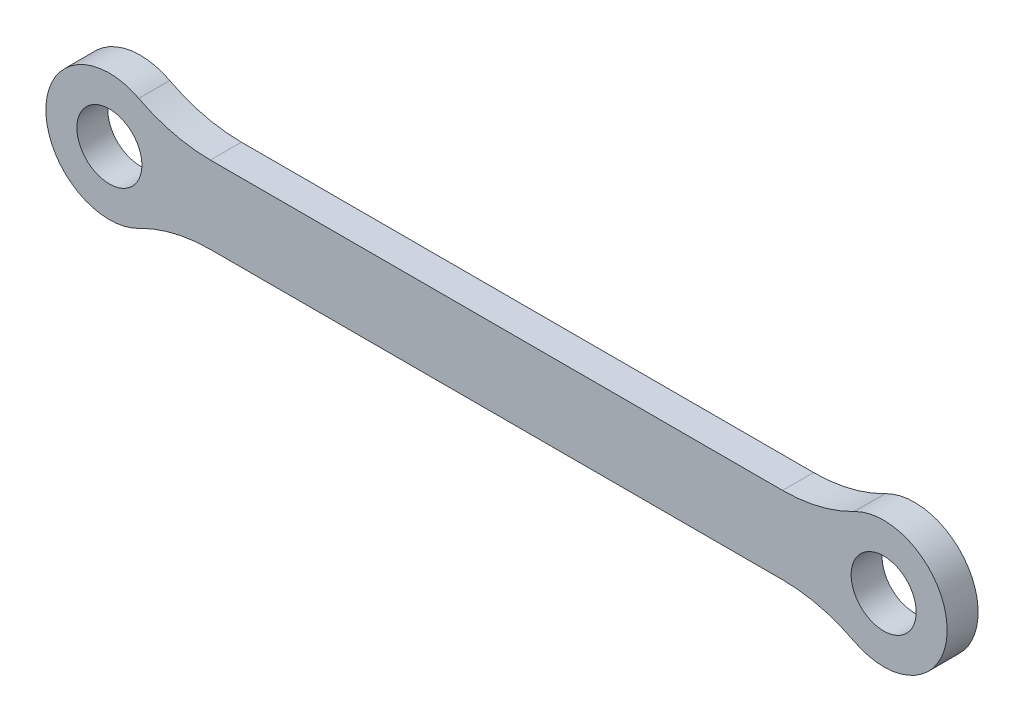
ISO-10303-21;
HEADER;
FILE_DESCRIPTION(('STEP AP214'),'2;1');
FILE_NAME('part.step','',(''),(''),'','','');
FILE_SCHEMA(('AUTOMOTIVE_DESIGN { 1 0 10303 214 1 1 1 1 }'));
ENDSEC;
DATA;
#1=APPLICATION_CONTEXT('core data for automotive mechanical design processes');
#2=APPLICATION_PROTOCOL_DEFINITION('international standard','automotive_design',2000,#1);
#3=PRODUCT_CONTEXT('',#1,'mechanical');
#4=PRODUCT('Part','Part','',(#3));
#5=PRODUCT_RELATED_PRODUCT_CATEGORY('part','',(#4));
#6=PRODUCT_DEFINITION_FORMATION('','',#4);
#7=PRODUCT_DEFINITION_CONTEXT('part definition',#1,'design');
#8=PRODUCT_DEFINITION('design','',#6,#7);
#9=PRODUCT_DEFINITION_SHAPE('','',#8);
#10=(LENGTH_UNIT() NAMED_UNIT(*) SI_UNIT(.MILLI.,.METRE.));
#11=(NAMED_UNIT(*) PLANE_ANGLE_UNIT() SI_UNIT($,.RADIAN.));
#12=(NAMED_UNIT(*) SI_UNIT($,.STERADIAN.) SOLID_ANGLE_UNIT());
#13=UNCERTAINTY_MEASURE_WITH_UNIT(LENGTH_MEASURE(1.E-05),#10,'distance_accuracy_value','');
#14=(GEOMETRIC_REPRESENTATION_CONTEXT(3) GLOBAL_UNCERTAINTY_ASSIGNED_CONTEXT((#13)) GLOBAL_UNIT_ASSIGNED_CONTEXT((#10,
#11,#12)) REPRESENTATION_CONTEXT('',''));
#15=CARTESIAN_POINT('',(0.,0.,0.));
#16=DIRECTION('',(0.,0.,1.));
#17=DIRECTION('',(1.,0.,0.));
#18=AXIS2_PLACEMENT_3D('',#15,#16,#17);
#19=CARTESIAN_POINT('',(-25.,0.,1.));
#20=DIRECTION('',(0.,0.,1.));
#21=DIRECTION('',(1.,0.,0.));
#22=AXIS2_PLACEMENT_3D('',#19,#20,#21);
#23=PLANE('',#22);
#24=CARTESIAN_POINT('',(25.,0.,1.));
#25=DIRECTION('',(0.,0.,1.));
#26=DIRECTION('',(1.,0.,0.));
#27=AXIS2_PLACEMENT_3D('',#24,#25,#26);
#28=CIRCLE('',#27,2.1);
#29=CARTESIAN_POINT('',(27.1,0.,1.));
#30=VERTEX_POINT('',#29);
#31=EDGE_CURVE('E147',#30,#30,#28,.T.);
#32=ORIENTED_EDGE('',*,*,#31,.F.);
#33=EDGE_LOOP('',(#32));
#34=FACE_BOUND('',#33,.T.);
#35=DIRECTION('',(-1.,0.,0.));
#36=VECTOR('',#35,1.);
#37=CARTESIAN_POINT('',(-21.7503846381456,2.5,1.));
#38=LINE('',#37,#36);
#39=CARTESIAN_POINT('',(18.47619742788,2.5,1.));
#40=VERTEX_POINT('',#39);
#41=CARTESIAN_POINT('',(-18.47619742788,2.5,1.));
#42=VERTEX_POINT('',#41);
#43=EDGE_CURVE('E155',#40,#42,#38,.T.);
#44=ORIENTED_EDGE('',*,*,#43,.T.);
#45=CARTESIAN_POINT('',(-18.47619742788,12.5,1.));
#46=DIRECTION('',(0.,0.,1.));
#47=DIRECTION('',(1.,0.,0.));
#48=AXIS2_PLACEMENT_3D('',#45,#46,#47);
#49=CIRCLE('',#48,10.);
#50=CARTESIAN_POINT('',(-23.1030077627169,3.63475177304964,1.));
#51=VERTEX_POINT('',#50);
#52=EDGE_CURVE('E11',#42,#51,#49,.F.);
#53=ORIENTED_EDGE('',*,*,#52,.T.);
#54=CARTESIAN_POINT('',(-25.,0.,1.));
#55=DIRECTION('',(0.,0.,1.));
#56=DIRECTION('',(1.,0.,0.));
#57=AXIS2_PLACEMENT_3D('',#54,#55,#56);
#58=CIRCLE('',#57,4.1);
#59=CARTESIAN_POINT('',(-23.1030077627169,-3.63475177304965,1.));
#60=VERTEX_POINT('',#59);
#61=EDGE_CURVE('E153',#51,#60,#58,.T.);
#62=ORIENTED_EDGE('',*,*,#61,.T.);
#63=CARTESIAN_POINT('',(-18.47619742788,-12.5,1.));
#64=DIRECTION('',(0.,0.,1.));
#65=DIRECTION('',(1.,0.,0.));
#66=AXIS2_PLACEMENT_3D('',#63,#64,#65);
#67=CIRCLE('',#66,10.);
#68=CARTESIAN_POINT('',(-18.47619742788,-2.5,1.));
#69=VERTEX_POINT('',#68);
#70=EDGE_CURVE('E120',#60,#69,#67,.F.);
#71=ORIENTED_EDGE('',*,*,#70,.T.);
#72=DIRECTION('',(1.,0.,0.));
#73=VECTOR('',#72,1.);
#74=CARTESIAN_POINT('',(-21.7503846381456,-2.5,1.));
#75=LINE('',#74,#73);
#76=CARTESIAN_POINT('',(18.47619742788,-2.5,1.));
#77=VERTEX_POINT('',#76);
#78=EDGE_CURVE('E130',#69,#77,#75,.T.);
#79=ORIENTED_EDGE('',*,*,#78,.T.);
#80=CARTESIAN_POINT('',(18.47619742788,-12.5,1.));
#81=DIRECTION('',(0.,0.,1.));
#82=DIRECTION('',(1.,0.,0.));
#83=AXIS2_PLACEMENT_3D('',#80,#81,#82);
#84=CIRCLE('',#83,10.);
#85=CARTESIAN_POINT('',(23.1030077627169,-3.63475177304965,1.));
#86=VERTEX_POINT('',#85);
#87=EDGE_CURVE('E174',#77,#86,#84,.F.);
#88=ORIENTED_EDGE('',*,*,#87,.T.);
#89=CARTESIAN_POINT('',(25.,0.,1.));
#90=DIRECTION('',(0.,0.,1.));
#91=DIRECTION('',(-1.,0.,0.));
#92=AXIS2_PLACEMENT_3D('',#89,#90,#91);
#93=CIRCLE('',#92,4.1);
#94=CARTESIAN_POINT('',(23.1030077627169,3.63475177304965,1.));
#95=VERTEX_POINT('',#94);
#96=EDGE_CURVE('E193',#86,#95,#93,.T.);
#97=ORIENTED_EDGE('',*,*,#96,.T.);
#98=CARTESIAN_POINT('',(18.47619742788,12.5,1.));
#99=DIRECTION('',(0.,0.,1.));
#100=DIRECTION('',(1.,0.,0.));
#101=AXIS2_PLACEMENT_3D('',#98,#99,#100);
#102=CIRCLE('',#101,10.);
#103=EDGE_CURVE('E61',#95,#40,#102,.F.);
#104=ORIENTED_EDGE('',*,*,#103,.T.);
#105=EDGE_LOOP('',(#44,#53,#62,#71,#79,#88,#97,#104));
#106=FACE_BOUND('',#105,.T.);
#107=CARTESIAN_POINT('',(-25.,0.,1.));
#108=DIRECTION('',(0.,0.,1.));
#109=DIRECTION('',(-1.,0.,0.));
#110=AXIS2_PLACEMENT_3D('',#107,#108,#109);
#111=CIRCLE('',#110,2.1);
#112=CARTESIAN_POINT('',(-27.1,0.,1.));
#113=VERTEX_POINT('',#112);
#114=EDGE_CURVE('E204',#113,#113,#111,.T.);
#115=ORIENTED_EDGE('',*,*,#114,.F.);
#116=EDGE_LOOP('',(#115));
#117=FACE_BOUND('',#116,.T.);
#118=ADVANCED_FACE('F36',(#34,#106,#117),#23,.T.);
#119=CARTESIAN_POINT('',(-25.,0.,-1.));
#120=DIRECTION('',(0.,0.,1.));
#121=DIRECTION('',(1.,0.,0.));
#122=AXIS2_PLACEMENT_3D('',#119,#120,#121);
#123=PLANE('',#122);
#124=CARTESIAN_POINT('',(-25.,0.,-1.));
#125=DIRECTION('',(0.,0.,1.));
#126=DIRECTION('',(1.,0.,0.));
#127=AXIS2_PLACEMENT_3D('',#124,#125,#126);
#128=CIRCLE('',#127,4.1);
#129=CARTESIAN_POINT('',(-23.1030077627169,3.63475177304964,-1.));
#130=VERTEX_POINT('',#129);
#131=CARTESIAN_POINT('',(-23.1030077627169,-3.63475177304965,-1.));
#132=VERTEX_POINT('',#131);
#133=EDGE_CURVE('E140',#130,#132,#128,.T.);
#134=ORIENTED_EDGE('',*,*,#133,.F.);
#135=CARTESIAN_POINT('',(-18.47619742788,12.5,-1.));
#136=DIRECTION('',(0.,0.,1.));
#137=DIRECTION('',(1.,0.,0.));
#138=AXIS2_PLACEMENT_3D('',#135,#136,#137);
#139=CIRCLE('',#138,10.);
#140=CARTESIAN_POINT('',(-18.47619742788,2.5,-1.));
#141=VERTEX_POINT('',#140);
#142=EDGE_CURVE('E44',#130,#141,#139,.T.);
#143=ORIENTED_EDGE('',*,*,#142,.T.);
#144=DIRECTION('',(-1.,0.,0.));
#145=VECTOR('',#144,1.);
#146=CARTESIAN_POINT('',(-21.7503846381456,2.5,-1.));
#147=LINE('',#146,#145);
#148=CARTESIAN_POINT('',(18.47619742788,2.5,-1.));
#149=VERTEX_POINT('',#148);
#150=EDGE_CURVE('E145',#149,#141,#147,.T.);
#151=ORIENTED_EDGE('',*,*,#150,.F.);
#152=CARTESIAN_POINT('',(18.47619742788,12.5,-1.));
#153=DIRECTION('',(0.,0.,1.));
#154=DIRECTION('',(1.,0.,0.));
#155=AXIS2_PLACEMENT_3D('',#152,#153,#154);
#156=CIRCLE('',#155,10.);
#157=CARTESIAN_POINT('',(23.1030077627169,3.63475177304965,-1.));
#158=VERTEX_POINT('',#157);
#159=EDGE_CURVE('E177',#149,#158,#156,.T.);
#160=ORIENTED_EDGE('',*,*,#159,.T.);
#161=CARTESIAN_POINT('',(25.,0.,-1.));
#162=DIRECTION('',(0.,0.,1.));
#163=DIRECTION('',(-1.,0.,0.));
#164=AXIS2_PLACEMENT_3D('',#161,#162,#163);
#165=CIRCLE('',#164,4.1);
#166=CARTESIAN_POINT('',(23.1030077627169,-3.63475177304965,-1.));
#167=VERTEX_POINT('',#166);
#168=EDGE_CURVE('E139',#167,#158,#165,.T.);
#169=ORIENTED_EDGE('',*,*,#168,.F.);
#170=CARTESIAN_POINT('',(18.47619742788,-12.5,-1.));
#171=DIRECTION('',(0.,0.,1.));
#172=DIRECTION('',(1.,0.,0.));
#173=AXIS2_PLACEMENT_3D('',#170,#171,#172);
#174=CIRCLE('',#173,10.);
#175=CARTESIAN_POINT('',(18.47619742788,-2.5,-1.));
#176=VERTEX_POINT('',#175);
#177=EDGE_CURVE('E137',#167,#176,#174,.T.);
#178=ORIENTED_EDGE('',*,*,#177,.T.);
#179=DIRECTION('',(1.,0.,0.));
#180=VECTOR('',#179,1.);
#181=CARTESIAN_POINT('',(-21.7503846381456,-2.5,-1.));
#182=LINE('',#181,#180);
#183=CARTESIAN_POINT('',(-18.47619742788,-2.5,-1.));
#184=VERTEX_POINT('',#183);
#185=EDGE_CURVE('E127',#184,#176,#182,.T.);
#186=ORIENTED_EDGE('',*,*,#185,.F.);
#187=CARTESIAN_POINT('',(-18.47619742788,-12.5,-1.));
#188=DIRECTION('',(0.,0.,1.));
#189=DIRECTION('',(1.,0.,0.));
#190=AXIS2_PLACEMENT_3D('',#187,#188,#189);
#191=CIRCLE('',#190,10.);
#192=EDGE_CURVE('E110',#184,#132,#191,.T.);
#193=ORIENTED_EDGE('',*,*,#192,.T.);
#194=EDGE_LOOP('',(#134,#143,#151,#160,#169,#178,#186,#193));
#195=FACE_BOUND('',#194,.T.);
#196=CARTESIAN_POINT('',(25.,0.,-1.));
#197=DIRECTION('',(0.,0.,1.));
#198=DIRECTION('',(1.,0.,0.));
#199=AXIS2_PLACEMENT_3D('',#196,#197,#198);
#200=CIRCLE('',#199,2.1);
#201=CARTESIAN_POINT('',(27.1,0.,-1.));
#202=VERTEX_POINT('',#201);
#203=EDGE_CURVE('E196',#202,#202,#200,.T.);
#204=ORIENTED_EDGE('',*,*,#203,.T.);
#205=EDGE_LOOP('',(#204));
#206=FACE_BOUND('',#205,.T.);
#207=CARTESIAN_POINT('',(-25.,0.,-1.));
#208=DIRECTION('',(0.,0.,1.));
#209=DIRECTION('',(-1.,0.,0.));
#210=AXIS2_PLACEMENT_3D('',#207,#208,#209);
#211=CIRCLE('',#210,2.1);
#212=CARTESIAN_POINT('',(-27.1,0.,-1.));
#213=VERTEX_POINT('',#212);
#214=EDGE_CURVE('E209',#213,#213,#211,.T.);
#215=ORIENTED_EDGE('',*,*,#214,.T.);
#216=EDGE_LOOP('',(#215));
#217=FACE_BOUND('',#216,.T.);
#218=ADVANCED_FACE('F134',(#195,#206,#217),#123,.F.);
#219=CARTESIAN_POINT('',(-25.,0.,1.));
#220=DIRECTION('',(0.,0.,-1.));
#221=DIRECTION('',(-1.,0.,0.));
#222=AXIS2_PLACEMENT_3D('',#219,#220,#221);
#223=CYLINDRICAL_SURFACE('',#222,4.1);
#224=ORIENTED_EDGE('',*,*,#133,.T.);
#225=DIRECTION('',(0.,0.,-1.));
#226=VECTOR('',#225,1.);
#227=CARTESIAN_POINT('',(-23.1030077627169,-3.63475177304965,1.));
#228=LINE('',#227,#226);
#229=EDGE_CURVE('E115',#132,#60,#228,.F.);
#230=ORIENTED_EDGE('',*,*,#229,.T.);
#231=ORIENTED_EDGE('',*,*,#61,.F.);
#232=DIRECTION('',(0.,0.,-1.));
#233=VECTOR('',#232,1.);
#234=CARTESIAN_POINT('',(-23.1030077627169,3.63475177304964,1.));
#235=LINE('',#234,#233);
#236=EDGE_CURVE('E131',#51,#130,#235,.T.);
#237=ORIENTED_EDGE('',*,*,#236,.T.);
#238=EDGE_LOOP('',(#224,#230,#231,#237));
#239=FACE_BOUND('',#238,.T.);
#240=ADVANCED_FACE('F191',(#239),#223,.T.);
#241=CARTESIAN_POINT('',(-21.7503846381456,-2.5,1.));
#242=DIRECTION('',(0.,1.,0.));
#243=DIRECTION('',(-1.,0.,0.));
#244=AXIS2_PLACEMENT_3D('',#241,#242,#243);
#245=PLANE('',#244);
#246=ORIENTED_EDGE('',*,*,#78,.F.);
#247=DIRECTION('',(0.,0.,1.));
#248=VECTOR('',#247,1.);
#249=CARTESIAN_POINT('',(-18.47619742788,-2.5,-1.));
#250=LINE('',#249,#248);
#251=EDGE_CURVE('E114',#69,#184,#250,.F.);
#252=ORIENTED_EDGE('',*,*,#251,.T.);
#253=ORIENTED_EDGE('',*,*,#185,.T.);
#254=DIRECTION('',(0.,0.,1.));
#255=VECTOR('',#254,1.);
#256=CARTESIAN_POINT('',(18.47619742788,-2.5,1.));
#257=LINE('',#256,#255);
#258=EDGE_CURVE('E132',#176,#77,#257,.T.);
#259=ORIENTED_EDGE('',*,*,#258,.T.);
#260=EDGE_LOOP('',(#246,#252,#253,#259));
#261=FACE_BOUND('',#260,.T.);
#262=ADVANCED_FACE('F126',(#261),#245,.F.);
#263=CARTESIAN_POINT('',(25.,0.,1.));
#264=DIRECTION('',(0.,0.,-1.));
#265=DIRECTION('',(-1.,0.,0.));
#266=AXIS2_PLACEMENT_3D('',#263,#264,#265);
#267=CYLINDRICAL_SURFACE('',#266,4.1);
#268=ORIENTED_EDGE('',*,*,#96,.F.);
#269=DIRECTION('',(0.,0.,-1.));
#270=VECTOR('',#269,1.);
#271=CARTESIAN_POINT('',(23.1030077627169,-3.63475177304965,1.));
#272=LINE('',#271,#270);
#273=EDGE_CURVE('E163',#86,#167,#272,.T.);
#274=ORIENTED_EDGE('',*,*,#273,.T.);
#275=ORIENTED_EDGE('',*,*,#168,.T.);
#276=DIRECTION('',(0.,0.,-1.));
#277=VECTOR('',#276,1.);
#278=CARTESIAN_POINT('',(23.1030077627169,3.63475177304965,1.));
#279=LINE('',#278,#277);
#280=EDGE_CURVE('E160',#158,#95,#279,.F.);
#281=ORIENTED_EDGE('',*,*,#280,.T.);
#282=EDGE_LOOP('',(#268,#274,#275,#281));
#283=FACE_BOUND('',#282,.T.);
#284=ADVANCED_FACE('F230',(#283),#267,.T.);
#285=CARTESIAN_POINT('',(-21.7503846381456,2.5,1.));
#286=DIRECTION('',(0.,-1.,0.));
#287=DIRECTION('',(1.,0.,0.));
#288=AXIS2_PLACEMENT_3D('',#285,#286,#287);
#289=PLANE('',#288);
#290=ORIENTED_EDGE('',*,*,#43,.F.);
#291=DIRECTION('',(0.,0.,1.));
#292=VECTOR('',#291,1.);
#293=CARTESIAN_POINT('',(18.47619742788,2.5,-1.));
#294=LINE('',#293,#292);
#295=EDGE_CURVE('E121',#40,#149,#294,.F.);
#296=ORIENTED_EDGE('',*,*,#295,.T.);
#297=ORIENTED_EDGE('',*,*,#150,.T.);
#298=DIRECTION('',(0.,0.,1.));
#299=VECTOR('',#298,1.);
#300=CARTESIAN_POINT('',(-18.47619742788,2.5,1.));
#301=LINE('',#300,#299);
#302=EDGE_CURVE('E51',#141,#42,#301,.T.);
#303=ORIENTED_EDGE('',*,*,#302,.T.);
#304=EDGE_LOOP('',(#290,#296,#297,#303));
#305=FACE_BOUND('',#304,.T.);
#306=ADVANCED_FACE('F184',(#305),#289,.F.);
#307=CARTESIAN_POINT('',(25.,0.,1.));
#308=DIRECTION('',(0.,0.,-1.));
#309=DIRECTION('',(-1.,0.,0.));
#310=AXIS2_PLACEMENT_3D('',#307,#308,#309);
#311=CYLINDRICAL_SURFACE('',#310,2.1);
#312=ORIENTED_EDGE('',*,*,#31,.T.);
#313=EDGE_LOOP('',(#312));
#314=FACE_BOUND('',#313,.T.);
#315=ORIENTED_EDGE('',*,*,#203,.F.);
#316=EDGE_LOOP('',(#315));
#317=FACE_BOUND('',#316,.T.);
#318=ADVANCED_FACE('F225',(#314,#317),#311,.F.);
#319=CARTESIAN_POINT('',(-25.,0.,1.));
#320=DIRECTION('',(0.,0.,-1.));
#321=DIRECTION('',(-1.,0.,0.));
#322=AXIS2_PLACEMENT_3D('',#319,#320,#321);
#323=CYLINDRICAL_SURFACE('',#322,2.1);
#324=ORIENTED_EDGE('',*,*,#114,.T.);
#325=EDGE_LOOP('',(#324));
#326=FACE_BOUND('',#325,.T.);
#327=ORIENTED_EDGE('',*,*,#214,.F.);
#328=EDGE_LOOP('',(#327));
#329=FACE_BOUND('',#328,.T.);
#330=ADVANCED_FACE('F215',(#326,#329),#323,.F.);
#331=CARTESIAN_POINT('',(-18.47619742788,-12.5,1.));
#332=DIRECTION('',(0.,0.,-1.));
#333=DIRECTION('',(-1.,0.,0.));
#334=AXIS2_PLACEMENT_3D('',#331,#332,#333);
#335=CYLINDRICAL_SURFACE('',#334,10.);
#336=ORIENTED_EDGE('',*,*,#70,.F.);
#337=ORIENTED_EDGE('',*,*,#229,.F.);
#338=ORIENTED_EDGE('',*,*,#192,.F.);
#339=ORIENTED_EDGE('',*,*,#251,.F.);
#340=EDGE_LOOP('',(#336,#337,#338,#339));
#341=FACE_BOUND('',#340,.T.);
#342=ADVANCED_FACE('F113',(#341),#335,.F.);
#343=CARTESIAN_POINT('',(18.47619742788,-12.5,1.));
#344=DIRECTION('',(0.,0.,-1.));
#345=DIRECTION('',(-1.,0.,0.));
#346=AXIS2_PLACEMENT_3D('',#343,#344,#345);
#347=CYLINDRICAL_SURFACE('',#346,10.);
#348=ORIENTED_EDGE('',*,*,#87,.F.);
#349=ORIENTED_EDGE('',*,*,#258,.F.);
#350=ORIENTED_EDGE('',*,*,#177,.F.);
#351=ORIENTED_EDGE('',*,*,#273,.F.);
#352=EDGE_LOOP('',(#348,#349,#350,#351));
#353=FACE_BOUND('',#352,.T.);
#354=ADVANCED_FACE('F240',(#353),#347,.F.);
#355=CARTESIAN_POINT('',(18.47619742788,12.5,1.));
#356=DIRECTION('',(0.,0.,-1.));
#357=DIRECTION('',(-1.,0.,0.));
#358=AXIS2_PLACEMENT_3D('',#355,#356,#357);
#359=CYLINDRICAL_SURFACE('',#358,10.);
#360=ORIENTED_EDGE('',*,*,#103,.F.);
#361=ORIENTED_EDGE('',*,*,#280,.F.);
#362=ORIENTED_EDGE('',*,*,#159,.F.);
#363=ORIENTED_EDGE('',*,*,#295,.F.);
#364=EDGE_LOOP('',(#360,#361,#362,#363));
#365=FACE_BOUND('',#364,.T.);
#366=ADVANCED_FACE('F242',(#365),#359,.F.);
#367=CARTESIAN_POINT('',(-18.47619742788,12.5,1.));
#368=DIRECTION('',(0.,0.,-1.));
#369=DIRECTION('',(-1.,0.,0.));
#370=AXIS2_PLACEMENT_3D('',#367,#368,#369);
#371=CYLINDRICAL_SURFACE('',#370,10.);
#372=ORIENTED_EDGE('',*,*,#52,.F.);
#373=ORIENTED_EDGE('',*,*,#302,.F.);
#374=ORIENTED_EDGE('',*,*,#142,.F.);
#375=ORIENTED_EDGE('',*,*,#236,.F.);
#376=EDGE_LOOP('',(#372,#373,#374,#375));
#377=FACE_BOUND('',#376,.T.);
#378=ADVANCED_FACE('F38',(#377),#371,.F.);
#379=CLOSED_SHELL('',(#118,#218,#240,#262,#284,#306,#318,#330,#342,#354,#366,#378));
#380=MANIFOLD_SOLID_BREP('B2',#379);
#381=ADVANCED_BREP_SHAPE_REPRESENTATION('',(#18,#380),#14);
#382=SHAPE_DEFINITION_REPRESENTATION(#9,#381);
ENDSEC;
END-ISO-10303-21;
